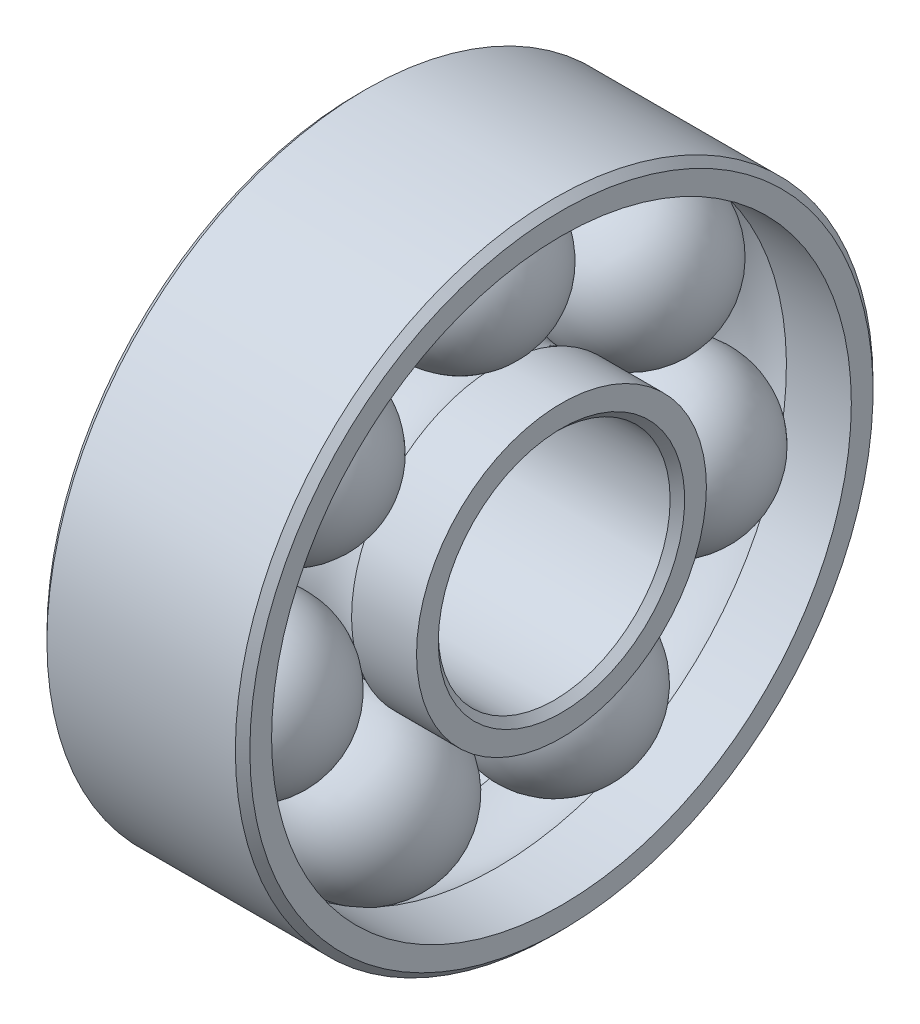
from build123d import *

# Parameters (mm, degrees)
R_P_TITION_CIRCULAIRE1_COUNT = 7


with BuildPart() as part:
    # Esquisse2 → Base-R_volution (revolve)
    with BuildSketch(Plane.XY, mode=Mode.PRIVATE) as base_r_volution_sk:
        with BuildLine():
            Line((-3.25, 4), (3.25, 4))
            Line((3.25, 4), (3.5, 4.25))
            Line((3.5, 4.25), (3.5, 5))
            Line((3.5, 5), (1.260952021, 5))
            ThreePointArc((1.260952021, 5), (0, 4.7), (-1.260952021, 5))
            Line((-1.260952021, 5), (-3.5, 5))
            Line((-3.5, 5), (-3.5, 4.25))
            Line((-3.5, 4.25), (-3.25, 4))
        make_face()
    revolve(base_r_volution_sk.sketch.rotate(Axis((-74.110126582, 0, 0), (1, 0, 0)), 90), axis=Axis((-74.110126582, 0, 0), (1, 0, 0)))

    # Esquisse3 → Boss.-R_vol.1 (revolve)
    with BuildSketch(Plane(origin=(0, 0, 0), x_dir=(0, 0, -1), z_dir=(1, 0, 0))):
        with BuildLine():
            Line((0, 10.31), (0, 4.69))
            ThreePointArc((0, 4.69), (2.81, 7.5), (0, 10.31))
        make_face()
    boss_r_vol_1 = revolve(axis=Axis((0, 12.548036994, 0), (0, -1, 0)))

    # R_p_tition circulaire1: Boss.-R_vol.1 ×7 about axis
    r_p_tition_circulaire1_axis = Axis((-74.110126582, 0, 0), (1, 0, 0))
    for i in range(1, R_P_TITION_CIRCULAIRE1_COUNT):
        add(boss_r_vol_1.rotate(r_p_tition_circulaire1_axis, i * 360 / R_P_TITION_CIRCULAIRE1_COUNT))

    # Esquisse5 → Boss.-R_vol.2 (revolve)
    with BuildSketch(Plane.XY, mode=Mode.PRIVATE) as boss_r_vol_2_sk:
        with BuildLine():
            Line((-3.25, 11), (3.25, 11))
            Line((3.25, 11), (3.5, 10.75))
            Line((3.5, 10.75), (3.5, 10))
            Line((3.5, 10), (1.260952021, 10))
            ThreePointArc((1.260952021, 10), (0, 10.3), (-1.260952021, 10))
            Line((-1.260952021, 10), (-3.5, 10))
            Line((-3.5, 10), (-3.5, 10.75))
            Line((-3.5, 10.75), (-3.25, 11))
        make_face()
    revolve(boss_r_vol_2_sk.sketch.rotate(Axis((-5.27889679, 0, 0), (1, 0, 0)), 90), axis=Axis((-5.27889679, 0, 0), (1, 0, 0)))


solid = part.part
